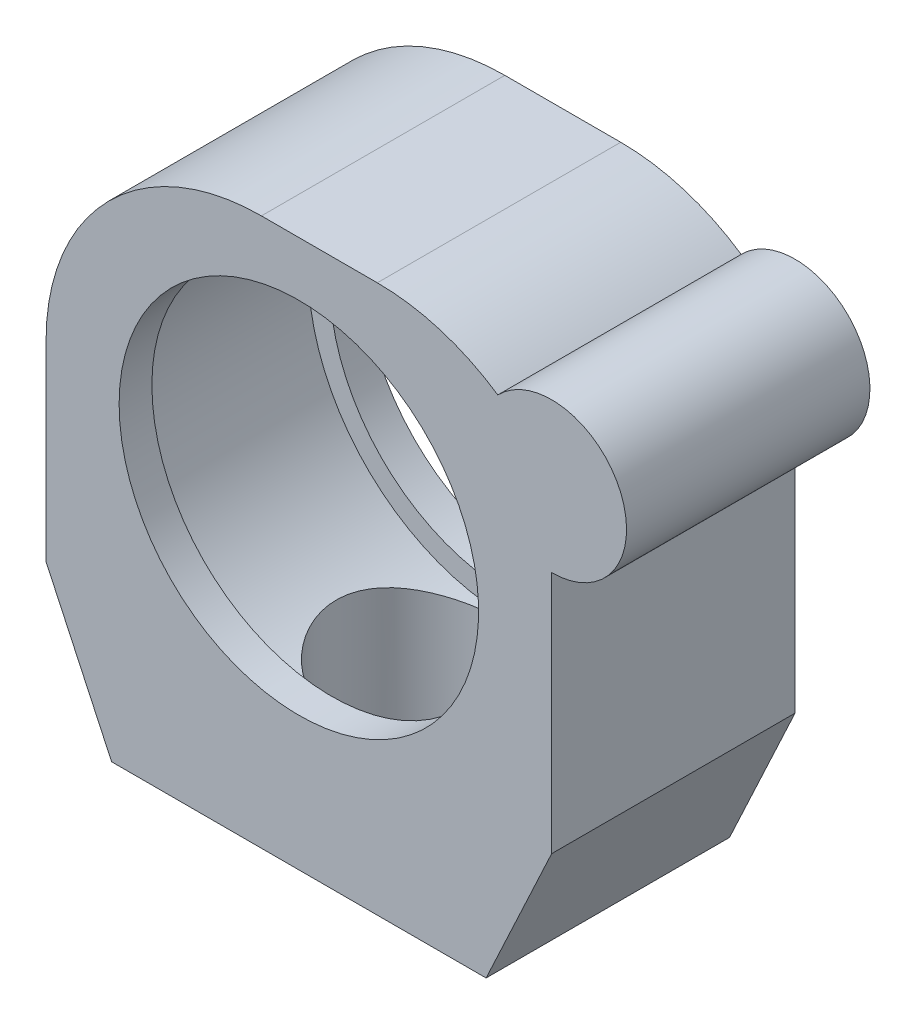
from build123d import *

# Parameters (mm, degrees)
BOSS_EXTRUDE1_DEPTH          = 13
CUT_EXTRUDE1_DEPTH           = 9.5
CUT_EXTRUDE1_DEPTH_BACK      = 9.5
SKETCH2_R                    = 21.5
CUT_EXTRUDE2_REACH           = 71.399
CUT_EXTRUDE2_END_RADIUS      = 21.5
SKETCH3_R                    = 9
F_6_0_6_DIAMETER_HOLE1_D     = 6
F_6_0_6_DIAMETER_HOLE1_DEPTH = 10
F_6_0_6_DIAMETER_HOLE1_TIP   = 1.802581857


with BuildPart() as part:
    # Sketch1 → Boss-Extrude1 (new, symmetric)
    with BuildSketch(Plane(origin=(0, 0, 0), x_dir=(-1, 0, 0), z_dir=(0, 0, -1))):
        with BuildLine():
            Line((-27, 7.5), (-27, -18.5))
            Line((-27, -18.5), (-20, -33.5))
            Line((-20, -33.5), (20, -33.5))
            Line((20, -33.5), (27, -18.5))
            Line((27, -18.5), (27, -15.5))
            Line((27, -15.5), (27, 2))
            ThreePointArc((27, 2), (20.263455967, 18.263455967), (4, 25))
            Line((4, 25), (-8.37877555, 25))
            ThreePointArc((-8.37877555, 25), (-15.10867012, 23.993374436), (-21.249479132, 21.061610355))
            ThreePointArc((-21.249479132, 21.061610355), (-34.365218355, 18.623068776), (-27, 7.5))
        make_face()
        with BuildLine():
            ThreePointArc((-16.651259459, 9.559056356), (-9.559056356, -16.651259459), (16.651259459, -9.559056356))
            ThreePointArc((16.651259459, -9.559056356), (9.559056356, 16.651259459), (-16.651259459, 9.559056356))
        make_face(mode=Mode.SUBTRACT)
    extrude(amount=BOSS_EXTRUDE1_DEPTH, both=True)

    # Sketch2 → Cut-Extrude1 (cut, two sides: drawn at the far end of the back side and taken through both)
    with BuildSketch(Plane.XY.offset(-CUT_EXTRUDE1_DEPTH_BACK)):
        Circle(SKETCH2_R)
    extrude(amount=CUT_EXTRUDE1_DEPTH + CUT_EXTRUDE1_DEPTH_BACK, mode=Mode.SUBTRACT)

    # Cut-Extrude2: up to this cylinder (the profile starts outside it)
    cut_extrude2_end = Plane(origin=(0, 0, 0), z_dir=(0, 0, -1)) * Cylinder(CUT_EXTRUDE2_END_RADIUS, 186.798, mode=Mode.PRIVATE)
    # Sketch3 → Cut-Extrude2 (cut, up to the surface)
    with BuildSketch(Plane.XZ.offset(33.5), mode=Mode.PRIVATE) as cut_extrude2_sk1:
        with Locations(Location((0, 0, 0), (0, 0, 270))):
            Circle(SKETCH3_R)
    cut_extrude2_tool1 = extrude(cut_extrude2_sk1.sketch, amount=-CUT_EXTRUDE2_REACH, mode=Mode.PRIVATE) - cut_extrude2_end
    add(cut_extrude2_tool1.solids().sort_by_distance((0, -33.5, 0))[0], mode=Mode.SUBTRACT)

    # 6.0 _6_ Diameter Hole1
    with Locations(Plane(origin=(0, -33.5, 0), x_dir=(-1, 0, 0), z_dir=(0, -1, 0))):
        with Locations((-15, 0), (15, 0)):
            Hole(F_6_0_6_DIAMETER_HOLE1_D / 2, depth=F_6_0_6_DIAMETER_HOLE1_DEPTH)
            with Locations((0, 0, -(F_6_0_6_DIAMETER_HOLE1_DEPTH + F_6_0_6_DIAMETER_HOLE1_TIP / 2))):  # 118° drill point
                Cone(0, F_6_0_6_DIAMETER_HOLE1_D / 2, F_6_0_6_DIAMETER_HOLE1_TIP, mode=Mode.SUBTRACT)


solid = part.part
